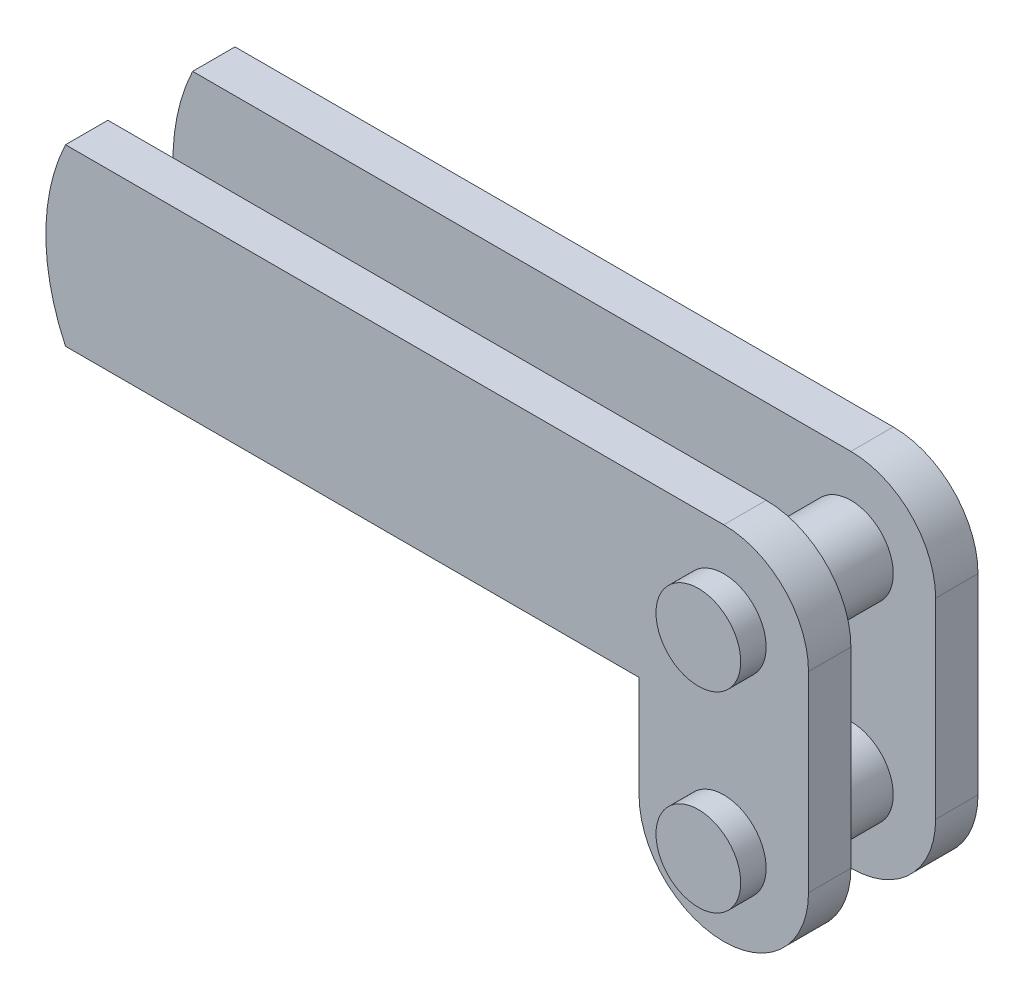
ISO-10303-21;
HEADER;
FILE_DESCRIPTION(('STEP AP214'),'2;1');
FILE_NAME('part.step','',(''),(''),'','','');
FILE_SCHEMA(('AUTOMOTIVE_DESIGN { 1 0 10303 214 1 1 1 1 }'));
ENDSEC;
DATA;
#1=APPLICATION_CONTEXT('core data for automotive mechanical design processes');
#2=APPLICATION_PROTOCOL_DEFINITION('international standard','automotive_design',2000,#1);
#3=PRODUCT_CONTEXT('',#1,'mechanical');
#4=PRODUCT('Part','Part','',(#3));
#5=PRODUCT_RELATED_PRODUCT_CATEGORY('part','',(#4));
#6=PRODUCT_DEFINITION_FORMATION('','',#4);
#7=PRODUCT_DEFINITION_CONTEXT('part definition',#1,'design');
#8=PRODUCT_DEFINITION('design','',#6,#7);
#9=PRODUCT_DEFINITION_SHAPE('','',#8);
#10=(LENGTH_UNIT() NAMED_UNIT(*) SI_UNIT(.MILLI.,.METRE.));
#11=(NAMED_UNIT(*) PLANE_ANGLE_UNIT() SI_UNIT($,.RADIAN.));
#12=(NAMED_UNIT(*) SI_UNIT($,.STERADIAN.) SOLID_ANGLE_UNIT());
#13=UNCERTAINTY_MEASURE_WITH_UNIT(LENGTH_MEASURE(1.E-05),#10,'distance_accuracy_value','');
#14=(GEOMETRIC_REPRESENTATION_CONTEXT(3) GLOBAL_UNCERTAINTY_ASSIGNED_CONTEXT((#13)) GLOBAL_UNIT_ASSIGNED_CONTEXT((#10,
#11,#12)) REPRESENTATION_CONTEXT('',''));
#15=CARTESIAN_POINT('',(0.,0.,0.));
#16=DIRECTION('',(0.,0.,1.));
#17=DIRECTION('',(1.,0.,0.));
#18=AXIS2_PLACEMENT_3D('',#15,#16,#17);
#19=CARTESIAN_POINT('',(-32.9999999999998,-5.15,-5.));
#20=DIRECTION('',(0.,0.,1.));
#21=DIRECTION('',(1.,0.,0.));
#22=AXIS2_PLACEMENT_3D('',#19,#20,#21);
#23=PLANE('',#22);
#24=CARTESIAN_POINT('',(-5.00000000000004,-16.3,-5.));
#25=DIRECTION('',(0.,0.,1.));
#26=DIRECTION('',(1.,0.,0.));
#27=AXIS2_PLACEMENT_3D('',#24,#25,#26);
#28=CIRCLE('',#27,2.5);
#29=CARTESIAN_POINT('',(-7.50000000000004,-16.2999999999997,-5.00000000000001));
#30=VERTEX_POINT('',#29);
#31=EDGE_CURVE('E40',#30,#30,#28,.F.);
#32=ORIENTED_EDGE('',*,*,#31,.F.);
#33=EDGE_LOOP('',(#32));
#34=FACE_BOUND('',#33,.T.);
#35=DIRECTION('',(-1.,0.,0.));
#36=VECTOR('',#35,1.);
#37=CARTESIAN_POINT('',(-43.8387037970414,0.,-5.));
#38=LINE('',#37,#36);
#39=CARTESIAN_POINT('',(-5.00000000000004,0.,-5.));
#40=VERTEX_POINT('',#39);
#41=CARTESIAN_POINT('',(-43.8387037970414,0.,-5.));
#42=VERTEX_POINT('',#41);
#43=EDGE_CURVE('E245',#40,#42,#38,.T.);
#44=ORIENTED_EDGE('',*,*,#43,.F.);
#45=CARTESIAN_POINT('',(-5.00000000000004,-5.,-5.));
#46=DIRECTION('',(0.,0.,1.));
#47=DIRECTION('',(1.,0.,0.));
#48=AXIS2_PLACEMENT_3D('',#45,#46,#47);
#49=CIRCLE('',#48,5.);
#50=CARTESIAN_POINT('',(1.59594559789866E-13,-5.,-5.));
#51=VERTEX_POINT('',#50);
#52=EDGE_CURVE('E172',#40,#51,#49,.F.);
#53=ORIENTED_EDGE('',*,*,#52,.T.);
#54=DIRECTION('',(0.,1.,0.));
#55=VECTOR('',#54,1.);
#56=CARTESIAN_POINT('',(0.,0.,-5.));
#57=LINE('',#56,#55);
#58=CARTESIAN_POINT('',(1.59594559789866E-13,-16.3,-5.));
#59=VERTEX_POINT('',#58);
#60=EDGE_CURVE('E241',#59,#51,#57,.T.);
#61=ORIENTED_EDGE('',*,*,#60,.F.);
#62=CARTESIAN_POINT('',(-5.00000000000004,-16.3,-5.));
#63=DIRECTION('',(0.,0.,1.));
#64=DIRECTION('',(1.,0.,0.));
#65=AXIS2_PLACEMENT_3D('',#62,#63,#64);
#66=CIRCLE('',#65,5.);
#67=CARTESIAN_POINT('',(-5.00000000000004,-21.2999999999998,-5.));
#68=VERTEX_POINT('',#67);
#69=EDGE_CURVE('E231',#59,#68,#66,.F.);
#70=ORIENTED_EDGE('',*,*,#69,.T.);
#71=CARTESIAN_POINT('',(-5.00000000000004,-16.3,-5.));
#72=DIRECTION('',(0.,0.,1.));
#73=DIRECTION('',(1.,0.,0.));
#74=AXIS2_PLACEMENT_3D('',#71,#72,#73);
#75=CIRCLE('',#74,5.);
#76=CARTESIAN_POINT('',(-10.0000000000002,-16.3,-5.));
#77=VERTEX_POINT('',#76);
#78=EDGE_CURVE('E232',#68,#77,#75,.F.);
#79=ORIENTED_EDGE('',*,*,#78,.T.);
#80=DIRECTION('',(0.,-1.,0.));
#81=VECTOR('',#80,1.);
#82=CARTESIAN_POINT('',(-10.,-21.3,-5.));
#83=LINE('',#82,#81);
#84=CARTESIAN_POINT('',(-10.0000000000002,-10.3,-5.));
#85=VERTEX_POINT('',#84);
#86=EDGE_CURVE('E253',#85,#77,#83,.T.);
#87=ORIENTED_EDGE('',*,*,#86,.F.);
#88=DIRECTION('',(1.,0.,0.));
#89=VECTOR('',#88,1.);
#90=CARTESIAN_POINT('',(-10.0000000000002,-10.3,-5.));
#91=LINE('',#90,#89);
#92=CARTESIAN_POINT('',(-43.8387037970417,-10.3,-5.));
#93=VERTEX_POINT('',#92);
#94=EDGE_CURVE('E278',#93,#85,#91,.T.);
#95=ORIENTED_EDGE('',*,*,#94,.F.);
#96=CARTESIAN_POINT('',(-32.9999999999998,-5.15,-5.));
#97=DIRECTION('',(0.,0.,1.));
#98=DIRECTION('',(1.,0.,0.));
#99=AXIS2_PLACEMENT_3D('',#96,#97,#98);
#100=CIRCLE('',#99,12.);
#101=EDGE_CURVE('E275',#42,#93,#100,.T.);
#102=ORIENTED_EDGE('',*,*,#101,.F.);
#103=EDGE_LOOP('',(#44,#53,#61,#70,#79,#87,#95,#102));
#104=FACE_BOUND('',#103,.T.);
#105=CARTESIAN_POINT('',(-5.00000000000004,-5.,-5.));
#106=DIRECTION('',(0.,0.,1.));
#107=DIRECTION('',(1.,0.,0.));
#108=AXIS2_PLACEMENT_3D('',#105,#106,#107);
#109=CIRCLE('',#108,2.5);
#110=CARTESIAN_POINT('',(-7.50000000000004,-4.99999999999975,-5.00000000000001));
#111=VERTEX_POINT('',#110);
#112=EDGE_CURVE('E11',#111,#111,#109,.F.);
#113=ORIENTED_EDGE('',*,*,#112,.F.);
#114=EDGE_LOOP('',(#113));
#115=FACE_BOUND('',#114,.T.);
#116=ADVANCED_FACE('F31',(#34,#104,#115),#23,.F.);
#117=CARTESIAN_POINT('',(-32.9999999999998,-5.14999999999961,5.));
#118=DIRECTION('',(0.,0.,1.));
#119=DIRECTION('',(1.,0.,0.));
#120=AXIS2_PLACEMENT_3D('',#117,#118,#119);
#121=PLANE('',#120);
#122=CARTESIAN_POINT('',(-5.00000000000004,-16.3,5.));
#123=DIRECTION('',(0.,0.,1.));
#124=DIRECTION('',(1.,0.,0.));
#125=AXIS2_PLACEMENT_3D('',#122,#123,#124);
#126=CIRCLE('',#125,2.5);
#127=CARTESIAN_POINT('',(-7.50000000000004,-16.2999999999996,5.));
#128=VERTEX_POINT('',#127);
#129=EDGE_CURVE('E35',#128,#128,#126,.F.);
#130=ORIENTED_EDGE('',*,*,#129,.T.);
#131=EDGE_LOOP('',(#130));
#132=FACE_BOUND('',#131,.T.);
#133=DIRECTION('',(0.,1.,0.));
#134=VECTOR('',#133,1.);
#135=CARTESIAN_POINT('',(0.,0.,5.));
#136=LINE('',#135,#134);
#137=CARTESIAN_POINT('',(1.59594559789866E-13,-16.3,5.));
#138=VERTEX_POINT('',#137);
#139=CARTESIAN_POINT('',(1.59594559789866E-13,-5.,5.));
#140=VERTEX_POINT('',#139);
#141=EDGE_CURVE('E166',#138,#140,#136,.T.);
#142=ORIENTED_EDGE('',*,*,#141,.T.);
#143=CARTESIAN_POINT('',(-5.00000000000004,-4.99999999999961,5.));
#144=DIRECTION('',(0.,0.,1.));
#145=DIRECTION('',(1.,0.,0.));
#146=AXIS2_PLACEMENT_3D('',#143,#144,#145);
#147=CIRCLE('',#146,5.);
#148=CARTESIAN_POINT('',(-5.00000000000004,3.95516952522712E-13,5.));
#149=VERTEX_POINT('',#148);
#150=EDGE_CURVE('E182',#140,#149,#147,.T.);
#151=ORIENTED_EDGE('',*,*,#150,.T.);
#152=DIRECTION('',(-1.,0.,0.));
#153=VECTOR('',#152,1.);
#154=CARTESIAN_POINT('',(-43.8387037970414,0.,5.));
#155=LINE('',#154,#153);
#156=CARTESIAN_POINT('',(-43.8387037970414,0.,5.));
#157=VERTEX_POINT('',#156);
#158=EDGE_CURVE('E209',#149,#157,#155,.T.);
#159=ORIENTED_EDGE('',*,*,#158,.T.);
#160=CARTESIAN_POINT('',(-32.9999999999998,-5.14999999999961,5.));
#161=DIRECTION('',(0.,0.,1.));
#162=DIRECTION('',(1.,0.,0.));
#163=AXIS2_PLACEMENT_3D('',#160,#161,#162);
#164=CIRCLE('',#163,12.);
#165=CARTESIAN_POINT('',(-43.8387037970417,-10.3,5.));
#166=VERTEX_POINT('',#165);
#167=EDGE_CURVE('E211',#157,#166,#164,.T.);
#168=ORIENTED_EDGE('',*,*,#167,.T.);
#169=DIRECTION('',(1.,0.,0.));
#170=VECTOR('',#169,1.);
#171=CARTESIAN_POINT('',(-10.0000000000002,-10.2999999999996,5.));
#172=LINE('',#171,#170);
#173=CARTESIAN_POINT('',(-10.0000000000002,-10.2999999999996,5.));
#174=VERTEX_POINT('',#173);
#175=EDGE_CURVE('E206',#166,#174,#172,.T.);
#176=ORIENTED_EDGE('',*,*,#175,.T.);
#177=DIRECTION('',(0.,-1.,0.));
#178=VECTOR('',#177,1.);
#179=CARTESIAN_POINT('',(-10.,-21.3,5.));
#180=LINE('',#179,#178);
#181=CARTESIAN_POINT('',(-10.0000000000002,-16.3,5.));
#182=VERTEX_POINT('',#181);
#183=EDGE_CURVE('E199',#174,#182,#180,.T.);
#184=ORIENTED_EDGE('',*,*,#183,.T.);
#185=CARTESIAN_POINT('',(-5.00000000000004,-16.3,5.));
#186=DIRECTION('',(0.,0.,1.));
#187=DIRECTION('',(1.,0.,0.));
#188=AXIS2_PLACEMENT_3D('',#185,#186,#187);
#189=CIRCLE('',#188,5.);
#190=CARTESIAN_POINT('',(-5.00000000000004,-21.2999999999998,5.));
#191=VERTEX_POINT('',#190);
#192=EDGE_CURVE('E179',#182,#191,#189,.T.);
#193=ORIENTED_EDGE('',*,*,#192,.T.);
#194=CARTESIAN_POINT('',(-5.00000000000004,-16.3,5.));
#195=DIRECTION('',(0.,0.,1.));
#196=DIRECTION('',(1.,0.,0.));
#197=AXIS2_PLACEMENT_3D('',#194,#195,#196);
#198=CIRCLE('',#197,5.);
#199=EDGE_CURVE('E177',#191,#138,#198,.T.);
#200=ORIENTED_EDGE('',*,*,#199,.T.);
#201=EDGE_LOOP('',(#142,#151,#159,#168,#176,#184,#193,#200));
#202=FACE_BOUND('',#201,.T.);
#203=CARTESIAN_POINT('',(-5.00000000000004,-4.99999999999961,5.));
#204=DIRECTION('',(0.,0.,1.));
#205=DIRECTION('',(1.,0.,0.));
#206=AXIS2_PLACEMENT_3D('',#203,#204,#205);
#207=CIRCLE('',#206,2.5);
#208=CARTESIAN_POINT('',(-7.50000000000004,-4.99999999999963,5.00000000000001));
#209=VERTEX_POINT('',#208);
#210=EDGE_CURVE('E601',#209,#209,#207,.F.);
#211=ORIENTED_EDGE('',*,*,#210,.T.);
#212=EDGE_LOOP('',(#211));
#213=FACE_BOUND('',#212,.T.);
#214=ADVANCED_FACE('F203',(#132,#202,#213),#121,.T.);
#215=CARTESIAN_POINT('',(-32.9999999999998,-5.14999999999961,5.));
#216=DIRECTION('',(0.,0.,-1.));
#217=DIRECTION('',(-1.,0.,0.));
#218=AXIS2_PLACEMENT_3D('',#215,#216,#217);
#219=CYLINDRICAL_SURFACE('',#218,12.);
#220=CARTESIAN_POINT('',(-32.9999999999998,-5.15,-2.5));
#221=DIRECTION('',(0.,0.,1.));
#222=DIRECTION('',(1.,0.,0.));
#223=AXIS2_PLACEMENT_3D('',#220,#221,#222);
#224=CIRCLE('',#223,12.);
#225=CARTESIAN_POINT('',(-43.8387037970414,0.,-2.5));
#226=VERTEX_POINT('',#225);
#227=CARTESIAN_POINT('',(-43.8387037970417,-10.3,-2.5));
#228=VERTEX_POINT('',#227);
#229=EDGE_CURVE('E262',#226,#228,#224,.T.);
#230=ORIENTED_EDGE('',*,*,#229,.F.);
#231=DIRECTION('',(0.,0.,-1.));
#232=VECTOR('',#231,1.);
#233=CARTESIAN_POINT('',(-43.8387037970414,0.,5.));
#234=LINE('',#233,#232);
#235=EDGE_CURVE('E216',#226,#42,#234,.T.);
#236=ORIENTED_EDGE('',*,*,#235,.T.);
#237=ORIENTED_EDGE('',*,*,#101,.T.);
#238=DIRECTION('',(0.,0.,-1.));
#239=VECTOR('',#238,1.);
#240=CARTESIAN_POINT('',(-43.8387037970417,-10.3,5.));
#241=LINE('',#240,#239);
#242=EDGE_CURVE('E223',#228,#93,#241,.T.);
#243=ORIENTED_EDGE('',*,*,#242,.F.);
#244=EDGE_LOOP('',(#230,#236,#237,#243));
#245=FACE_BOUND('',#244,.T.);
#246=ADVANCED_FACE('F323',(#245),#219,.T.);
#247=CARTESIAN_POINT('',(-10.0000000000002,-10.2999999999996,5.));
#248=DIRECTION('',(0.,1.,0.));
#249=DIRECTION('',(-1.,0.,0.));
#250=AXIS2_PLACEMENT_3D('',#247,#248,#249);
#251=PLANE('',#250);
#252=DIRECTION('',(1.,0.,0.));
#253=VECTOR('',#252,1.);
#254=CARTESIAN_POINT('',(-43.8387037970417,-10.3,-2.5));
#255=LINE('',#254,#253);
#256=CARTESIAN_POINT('',(-10.0000000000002,-10.2999999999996,-2.5));
#257=VERTEX_POINT('',#256);
#258=EDGE_CURVE('E269',#228,#257,#255,.T.);
#259=ORIENTED_EDGE('',*,*,#258,.F.);
#260=ORIENTED_EDGE('',*,*,#242,.T.);
#261=ORIENTED_EDGE('',*,*,#94,.T.);
#262=DIRECTION('',(0.,0.,-1.));
#263=VECTOR('',#262,1.);
#264=CARTESIAN_POINT('',(-10.0000000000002,-10.2999999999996,5.));
#265=LINE('',#264,#263);
#266=EDGE_CURVE('E220',#257,#85,#265,.T.);
#267=ORIENTED_EDGE('',*,*,#266,.F.);
#268=EDGE_LOOP('',(#259,#260,#261,#267));
#269=FACE_BOUND('',#268,.T.);
#270=ADVANCED_FACE('F339',(#269),#251,.F.);
#271=CARTESIAN_POINT('',(-10.,-21.3,5.));
#272=DIRECTION('',(1.,0.,0.));
#273=DIRECTION('',(0.,0.,-1.));
#274=AXIS2_PLACEMENT_3D('',#271,#272,#273);
#275=PLANE('',#274);
#276=DIRECTION('',(0.,-1.,0.));
#277=VECTOR('',#276,1.);
#278=CARTESIAN_POINT('',(-10.0000000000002,-10.2999999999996,-2.5));
#279=LINE('',#278,#277);
#280=CARTESIAN_POINT('',(-10.0000000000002,-16.3,-2.5));
#281=VERTEX_POINT('',#280);
#282=EDGE_CURVE('E56',#257,#281,#279,.T.);
#283=ORIENTED_EDGE('',*,*,#282,.F.);
#284=ORIENTED_EDGE('',*,*,#266,.T.);
#285=ORIENTED_EDGE('',*,*,#86,.T.);
#286=DIRECTION('',(0.,0.,-1.));
#287=VECTOR('',#286,1.);
#288=CARTESIAN_POINT('',(-10.0000000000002,-16.3,5.));
#289=LINE('',#288,#287);
#290=EDGE_CURVE('E184',#77,#281,#289,.F.);
#291=ORIENTED_EDGE('',*,*,#290,.T.);
#292=EDGE_LOOP('',(#283,#284,#285,#291));
#293=FACE_BOUND('',#292,.T.);
#294=ADVANCED_FACE('F337',(#293),#275,.F.);
#295=CARTESIAN_POINT('',(0.,0.,5.));
#296=DIRECTION('',(-1.,0.,0.));
#297=DIRECTION('',(0.,-1.,0.));
#298=AXIS2_PLACEMENT_3D('',#295,#296,#297);
#299=PLANE('',#298);
#300=DIRECTION('',(0.,1.,0.));
#301=VECTOR('',#300,1.);
#302=CARTESIAN_POINT('',(1.59594559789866E-13,-16.3,-2.5));
#303=LINE('',#302,#301);
#304=CARTESIAN_POINT('',(1.59594559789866E-13,-16.3,-2.5));
#305=VERTEX_POINT('',#304);
#306=CARTESIAN_POINT('',(1.59594559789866E-13,-5.,-2.5));
#307=VERTEX_POINT('',#306);
#308=EDGE_CURVE('E260',#305,#307,#303,.T.);
#309=ORIENTED_EDGE('',*,*,#308,.F.);
#310=DIRECTION('',(0.,0.,-1.));
#311=VECTOR('',#310,1.);
#312=CARTESIAN_POINT('',(1.59594559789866E-13,-16.3,5.));
#313=LINE('',#312,#311);
#314=EDGE_CURVE('E168',#305,#59,#313,.T.);
#315=ORIENTED_EDGE('',*,*,#314,.T.);
#316=ORIENTED_EDGE('',*,*,#60,.T.);
#317=DIRECTION('',(0.,0.,-1.));
#318=VECTOR('',#317,1.);
#319=CARTESIAN_POINT('',(1.59594559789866E-13,-5.,5.));
#320=LINE('',#319,#318);
#321=EDGE_CURVE('E170',#51,#307,#320,.F.);
#322=ORIENTED_EDGE('',*,*,#321,.T.);
#323=EDGE_LOOP('',(#309,#315,#316,#322));
#324=FACE_BOUND('',#323,.T.);
#325=ADVANCED_FACE('F251',(#324),#299,.F.);
#326=CARTESIAN_POINT('',(-43.8387037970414,0.,5.));
#327=DIRECTION('',(0.,-1.,0.));
#328=DIRECTION('',(0.,0.,-1.));
#329=AXIS2_PLACEMENT_3D('',#326,#327,#328);
#330=PLANE('',#329);
#331=DIRECTION('',(-1.,0.,0.));
#332=VECTOR('',#331,1.);
#333=CARTESIAN_POINT('',(-5.00000000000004,0.,-2.5));
#334=LINE('',#333,#332);
#335=CARTESIAN_POINT('',(-5.00000000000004,0.,-2.5));
#336=VERTEX_POINT('',#335);
#337=EDGE_CURVE('E259',#336,#226,#334,.T.);
#338=ORIENTED_EDGE('',*,*,#337,.F.);
#339=DIRECTION('',(0.,0.,-1.));
#340=VECTOR('',#339,1.);
#341=CARTESIAN_POINT('',(-5.00000000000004,3.95516952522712E-13,5.));
#342=LINE('',#341,#340);
#343=EDGE_CURVE('E227',#336,#40,#342,.T.);
#344=ORIENTED_EDGE('',*,*,#343,.T.);
#345=ORIENTED_EDGE('',*,*,#43,.T.);
#346=ORIENTED_EDGE('',*,*,#235,.F.);
#347=EDGE_LOOP('',(#338,#344,#345,#346));
#348=FACE_BOUND('',#347,.T.);
#349=ADVANCED_FACE('F333',(#348),#330,.F.);
#350=CARTESIAN_POINT('',(-5.00000000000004,-4.99999999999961,5.));
#351=DIRECTION('',(0.,0.,-1.));
#352=DIRECTION('',(-1.,0.,0.));
#353=AXIS2_PLACEMENT_3D('',#350,#351,#352);
#354=CYLINDRICAL_SURFACE('',#353,5.);
#355=ORIENTED_EDGE('',*,*,#343,.F.);
#356=CARTESIAN_POINT('',(-5.00000000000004,-5.,-2.5));
#357=DIRECTION('',(0.,0.,1.));
#358=DIRECTION('',(1.,0.,0.));
#359=AXIS2_PLACEMENT_3D('',#356,#357,#358);
#360=CIRCLE('',#359,5.);
#361=EDGE_CURVE('E257',#307,#336,#360,.T.);
#362=ORIENTED_EDGE('',*,*,#361,.F.);
#363=ORIENTED_EDGE('',*,*,#321,.F.);
#364=ORIENTED_EDGE('',*,*,#52,.F.);
#365=EDGE_LOOP('',(#355,#362,#363,#364));
#366=FACE_BOUND('',#365,.T.);
#367=ADVANCED_FACE('F256',(#366),#354,.T.);
#368=CARTESIAN_POINT('',(-5.00000000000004,-16.3,5.));
#369=DIRECTION('',(0.,0.,-1.));
#370=DIRECTION('',(-1.,0.,0.));
#371=AXIS2_PLACEMENT_3D('',#368,#369,#370);
#372=CYLINDRICAL_SURFACE('',#371,5.);
#373=ORIENTED_EDGE('',*,*,#314,.F.);
#374=CARTESIAN_POINT('',(-5.00000000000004,-16.3,-2.5));
#375=DIRECTION('',(0.,0.,1.));
#376=DIRECTION('',(1.,0.,0.));
#377=AXIS2_PLACEMENT_3D('',#374,#375,#376);
#378=CIRCLE('',#377,5.);
#379=CARTESIAN_POINT('',(-5.00000000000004,-21.2999999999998,-2.5));
#380=VERTEX_POINT('',#379);
#381=EDGE_CURVE('E298',#380,#305,#378,.T.);
#382=ORIENTED_EDGE('',*,*,#381,.F.);
#383=DIRECTION('',(0.,0.,-1.));
#384=VECTOR('',#383,1.);
#385=CARTESIAN_POINT('',(-5.00000000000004,-21.2999999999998,5.));
#386=LINE('',#385,#384);
#387=EDGE_CURVE('E272',#68,#380,#386,.F.);
#388=ORIENTED_EDGE('',*,*,#387,.F.);
#389=ORIENTED_EDGE('',*,*,#69,.F.);
#390=EDGE_LOOP('',(#373,#382,#388,#389));
#391=FACE_BOUND('',#390,.T.);
#392=ADVANCED_FACE('F303',(#391),#372,.T.);
#393=CARTESIAN_POINT('',(-5.00000000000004,-16.3,5.));
#394=DIRECTION('',(0.,0.,-1.));
#395=DIRECTION('',(-1.,0.,0.));
#396=AXIS2_PLACEMENT_3D('',#393,#394,#395);
#397=CYLINDRICAL_SURFACE('',#396,5.);
#398=ORIENTED_EDGE('',*,*,#387,.T.);
#399=EDGE_CURVE('E264',#281,#380,#378,.T.);
#400=ORIENTED_EDGE('',*,*,#399,.F.);
#401=ORIENTED_EDGE('',*,*,#290,.F.);
#402=ORIENTED_EDGE('',*,*,#78,.F.);
#403=EDGE_LOOP('',(#398,#400,#401,#402));
#404=FACE_BOUND('',#403,.T.);
#405=ADVANCED_FACE('F305',(#404),#397,.T.);
#406=CARTESIAN_POINT('',(-5.00000000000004,-16.3,-2.5));
#407=DIRECTION('',(0.,0.,1.));
#408=DIRECTION('',(1.,0.,0.));
#409=AXIS2_PLACEMENT_3D('',#406,#407,#408);
#410=PLANE('',#409);
#411=CARTESIAN_POINT('',(-5.00000000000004,-16.3,-2.5));
#412=DIRECTION('',(0.,0.,1.));
#413=DIRECTION('',(1.,0.,0.));
#414=AXIS2_PLACEMENT_3D('',#411,#412,#413);
#415=CIRCLE('',#414,2.5);
#416=CARTESIAN_POINT('',(-2.50000000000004,-16.3,-2.5));
#417=VERTEX_POINT('',#416);
#418=EDGE_CURVE('E584',#417,#417,#415,.T.);
#419=ORIENTED_EDGE('',*,*,#418,.F.);
#420=EDGE_LOOP('',(#419));
#421=FACE_BOUND('',#420,.T.);
#422=CARTESIAN_POINT('',(-5.00000000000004,-5.,-2.5));
#423=DIRECTION('',(0.,0.,1.));
#424=DIRECTION('',(1.,0.,0.));
#425=AXIS2_PLACEMENT_3D('',#422,#423,#424);
#426=CIRCLE('',#425,2.5);
#427=CARTESIAN_POINT('',(-2.50000000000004,-5.,-2.5));
#428=VERTEX_POINT('',#427);
#429=EDGE_CURVE('E151',#428,#428,#426,.T.);
#430=ORIENTED_EDGE('',*,*,#429,.F.);
#431=EDGE_LOOP('',(#430));
#432=FACE_BOUND('',#431,.T.);
#433=ORIENTED_EDGE('',*,*,#399,.T.);
#434=ORIENTED_EDGE('',*,*,#381,.T.);
#435=ORIENTED_EDGE('',*,*,#308,.T.);
#436=ORIENTED_EDGE('',*,*,#361,.T.);
#437=ORIENTED_EDGE('',*,*,#337,.T.);
#438=ORIENTED_EDGE('',*,*,#229,.T.);
#439=ORIENTED_EDGE('',*,*,#258,.T.);
#440=ORIENTED_EDGE('',*,*,#282,.T.);
#441=EDGE_LOOP('',(#433,#434,#435,#436,#437,#438,#439,#440));
#442=FACE_BOUND('',#441,.T.);
#443=ADVANCED_FACE('F300',(#421,#432,#442),#410,.T.);
#444=CARTESIAN_POINT('',(-5.00000000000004,-16.3,2.5));
#445=DIRECTION('',(0.,0.,1.));
#446=DIRECTION('',(1.,0.,0.));
#447=AXIS2_PLACEMENT_3D('',#444,#445,#446);
#448=PLANE('',#447);
#449=CARTESIAN_POINT('',(-5.00000000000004,-16.3,2.5));
#450=DIRECTION('',(0.,0.,1.));
#451=DIRECTION('',(1.,0.,0.));
#452=AXIS2_PLACEMENT_3D('',#449,#450,#451);
#453=CIRCLE('',#452,2.5);
#454=CARTESIAN_POINT('',(-2.50000000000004,-16.3,2.5));
#455=VERTEX_POINT('',#454);
#456=EDGE_CURVE('E579',#455,#455,#453,.T.);
#457=ORIENTED_EDGE('',*,*,#456,.T.);
#458=EDGE_LOOP('',(#457));
#459=FACE_BOUND('',#458,.T.);
#460=CARTESIAN_POINT('',(-5.00000000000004,-4.99999999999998,2.5));
#461=DIRECTION('',(0.,0.,1.));
#462=DIRECTION('',(1.,0.,0.));
#463=AXIS2_PLACEMENT_3D('',#460,#461,#462);
#464=CIRCLE('',#463,2.5);
#465=CARTESIAN_POINT('',(-2.50000000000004,-4.99999999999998,2.5));
#466=VERTEX_POINT('',#465);
#467=EDGE_CURVE('E582',#466,#466,#464,.T.);
#468=ORIENTED_EDGE('',*,*,#467,.T.);
#469=EDGE_LOOP('',(#468));
#470=FACE_BOUND('',#469,.T.);
#471=CARTESIAN_POINT('',(-5.00000000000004,-16.3,2.5));
#472=DIRECTION('',(0.,0.,1.));
#473=DIRECTION('',(1.,0.,0.));
#474=AXIS2_PLACEMENT_3D('',#471,#472,#473);
#475=CIRCLE('',#474,5.);
#476=CARTESIAN_POINT('',(-10.0000000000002,-16.3,2.5));
#477=VERTEX_POINT('',#476);
#478=CARTESIAN_POINT('',(-5.00000000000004,-21.2999999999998,2.5));
#479=VERTEX_POINT('',#478);
#480=EDGE_CURVE('E160',#477,#479,#475,.T.);
#481=ORIENTED_EDGE('',*,*,#480,.F.);
#482=DIRECTION('',(0.,-1.,0.));
#483=VECTOR('',#482,1.);
#484=CARTESIAN_POINT('',(-10.0000000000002,-10.2999999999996,2.5));
#485=LINE('',#484,#483);
#486=CARTESIAN_POINT('',(-10.0000000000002,-10.2999999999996,2.5));
#487=VERTEX_POINT('',#486);
#488=EDGE_CURVE('E161',#487,#477,#485,.T.);
#489=ORIENTED_EDGE('',*,*,#488,.F.);
#490=DIRECTION('',(1.,0.,0.));
#491=VECTOR('',#490,1.);
#492=CARTESIAN_POINT('',(-43.8387037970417,-10.3,2.5));
#493=LINE('',#492,#491);
#494=CARTESIAN_POINT('',(-43.8387037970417,-10.3,2.5));
#495=VERTEX_POINT('',#494);
#496=EDGE_CURVE('E292',#495,#487,#493,.T.);
#497=ORIENTED_EDGE('',*,*,#496,.F.);
#498=CARTESIAN_POINT('',(-32.9999999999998,-5.14999999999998,2.5));
#499=DIRECTION('',(0.,0.,1.));
#500=DIRECTION('',(1.,0.,0.));
#501=AXIS2_PLACEMENT_3D('',#498,#499,#500);
#502=CIRCLE('',#501,12.);
#503=CARTESIAN_POINT('',(-43.8387037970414,0.,2.5));
#504=VERTEX_POINT('',#503);
#505=EDGE_CURVE('E288',#504,#495,#502,.T.);
#506=ORIENTED_EDGE('',*,*,#505,.F.);
#507=DIRECTION('',(-1.,0.,0.));
#508=VECTOR('',#507,1.);
#509=CARTESIAN_POINT('',(-5.00000000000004,0.,2.5));
#510=LINE('',#509,#508);
#511=CARTESIAN_POINT('',(-5.00000000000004,0.,2.5));
#512=VERTEX_POINT('',#511);
#513=EDGE_CURVE('E295',#512,#504,#510,.T.);
#514=ORIENTED_EDGE('',*,*,#513,.F.);
#515=CARTESIAN_POINT('',(-5.00000000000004,-4.99999999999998,2.5));
#516=DIRECTION('',(0.,0.,1.));
#517=DIRECTION('',(1.,0.,0.));
#518=AXIS2_PLACEMENT_3D('',#515,#516,#517);
#519=CIRCLE('',#518,5.);
#520=CARTESIAN_POINT('',(1.59594559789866E-13,-5.,2.5));
#521=VERTEX_POINT('',#520);
#522=EDGE_CURVE('E147',#521,#512,#519,.T.);
#523=ORIENTED_EDGE('',*,*,#522,.F.);
#524=DIRECTION('',(0.,1.,0.));
#525=VECTOR('',#524,1.);
#526=CARTESIAN_POINT('',(1.59594559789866E-13,-16.3,2.5));
#527=LINE('',#526,#525);
#528=CARTESIAN_POINT('',(1.59594559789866E-13,-16.3,2.5));
#529=VERTEX_POINT('',#528);
#530=EDGE_CURVE('E144',#529,#521,#527,.T.);
#531=ORIENTED_EDGE('',*,*,#530,.F.);
#532=EDGE_CURVE('E48',#479,#529,#475,.T.);
#533=ORIENTED_EDGE('',*,*,#532,.F.);
#534=EDGE_LOOP('',(#481,#489,#497,#506,#514,#523,#531,#533));
#535=FACE_BOUND('',#534,.T.);
#536=ADVANCED_FACE('F145',(#459,#470,#535),#448,.F.);
#537=CARTESIAN_POINT('',(-5.00000000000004,-5.,-2.5));
#538=DIRECTION('',(0.,0.,1.));
#539=DIRECTION('',(1.,0.,0.));
#540=AXIS2_PLACEMENT_3D('',#537,#538,#539);
#541=CYLINDRICAL_SURFACE('',#540,2.5);
#542=ORIENTED_EDGE('',*,*,#429,.T.);
#543=EDGE_LOOP('',(#542));
#544=FACE_BOUND('',#543,.T.);
#545=ORIENTED_EDGE('',*,*,#467,.F.);
#546=EDGE_LOOP('',(#545));
#547=FACE_BOUND('',#546,.T.);
#548=ADVANCED_FACE('F527',(#544,#547),#541,.T.);
#549=CARTESIAN_POINT('',(-5.00000000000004,-16.3,-2.5));
#550=DIRECTION('',(0.,0.,1.));
#551=DIRECTION('',(1.,0.,0.));
#552=AXIS2_PLACEMENT_3D('',#549,#550,#551);
#553=CYLINDRICAL_SURFACE('',#552,2.5);
#554=ORIENTED_EDGE('',*,*,#418,.T.);
#555=EDGE_LOOP('',(#554));
#556=FACE_BOUND('',#555,.T.);
#557=ORIENTED_EDGE('',*,*,#456,.F.);
#558=EDGE_LOOP('',(#557));
#559=FACE_BOUND('',#558,.T.);
#560=ADVANCED_FACE('F519',(#556,#559),#553,.T.);
#561=ORIENTED_EDGE('',*,*,#522,.T.);
#562=EDGE_CURVE('E228',#149,#512,#342,.T.);
#563=ORIENTED_EDGE('',*,*,#562,.F.);
#564=ORIENTED_EDGE('',*,*,#150,.F.);
#565=EDGE_CURVE('E167',#521,#140,#320,.F.);
#566=ORIENTED_EDGE('',*,*,#565,.F.);
#567=EDGE_LOOP('',(#561,#563,#564,#566));
#568=FACE_BOUND('',#567,.T.);
#569=ADVANCED_FACE('F328',(#568),#354,.T.);
#570=ORIENTED_EDGE('',*,*,#562,.T.);
#571=ORIENTED_EDGE('',*,*,#513,.T.);
#572=EDGE_CURVE('E217',#157,#504,#234,.T.);
#573=ORIENTED_EDGE('',*,*,#572,.F.);
#574=ORIENTED_EDGE('',*,*,#158,.F.);
#575=EDGE_LOOP('',(#570,#571,#573,#574));
#576=FACE_BOUND('',#575,.T.);
#577=ADVANCED_FACE('F316',(#576),#330,.F.);
#578=ORIENTED_EDGE('',*,*,#480,.T.);
#579=EDGE_CURVE('E159',#479,#191,#386,.F.);
#580=ORIENTED_EDGE('',*,*,#579,.T.);
#581=ORIENTED_EDGE('',*,*,#192,.F.);
#582=EDGE_CURVE('E183',#477,#182,#289,.F.);
#583=ORIENTED_EDGE('',*,*,#582,.F.);
#584=EDGE_LOOP('',(#578,#580,#581,#583));
#585=FACE_BOUND('',#584,.T.);
#586=ADVANCED_FACE('F201',(#585),#397,.T.);
#587=ORIENTED_EDGE('',*,*,#532,.T.);
#588=EDGE_CURVE('E158',#138,#529,#313,.T.);
#589=ORIENTED_EDGE('',*,*,#588,.F.);
#590=ORIENTED_EDGE('',*,*,#199,.F.);
#591=ORIENTED_EDGE('',*,*,#579,.F.);
#592=EDGE_LOOP('',(#587,#589,#590,#591));
#593=FACE_BOUND('',#592,.T.);
#594=ADVANCED_FACE('F156',(#593),#372,.T.);
#595=ORIENTED_EDGE('',*,*,#588,.T.);
#596=ORIENTED_EDGE('',*,*,#530,.T.);
#597=ORIENTED_EDGE('',*,*,#565,.T.);
#598=ORIENTED_EDGE('',*,*,#141,.F.);
#599=EDGE_LOOP('',(#595,#596,#597,#598));
#600=FACE_BOUND('',#599,.T.);
#601=ADVANCED_FACE('F164',(#600),#299,.F.);
#602=EDGE_CURVE('E221',#174,#487,#265,.T.);
#603=ORIENTED_EDGE('',*,*,#602,.T.);
#604=ORIENTED_EDGE('',*,*,#488,.T.);
#605=ORIENTED_EDGE('',*,*,#582,.T.);
#606=ORIENTED_EDGE('',*,*,#183,.F.);
#607=EDGE_LOOP('',(#603,#604,#605,#606));
#608=FACE_BOUND('',#607,.T.);
#609=ADVANCED_FACE('F197',(#608),#275,.F.);
#610=EDGE_CURVE('E224',#166,#495,#241,.T.);
#611=ORIENTED_EDGE('',*,*,#610,.T.);
#612=ORIENTED_EDGE('',*,*,#496,.T.);
#613=ORIENTED_EDGE('',*,*,#602,.F.);
#614=ORIENTED_EDGE('',*,*,#175,.F.);
#615=EDGE_LOOP('',(#611,#612,#613,#614));
#616=FACE_BOUND('',#615,.T.);
#617=ADVANCED_FACE('F291',(#616),#251,.F.);
#618=ORIENTED_EDGE('',*,*,#572,.T.);
#619=ORIENTED_EDGE('',*,*,#505,.T.);
#620=ORIENTED_EDGE('',*,*,#610,.F.);
#621=ORIENTED_EDGE('',*,*,#167,.F.);
#622=EDGE_LOOP('',(#618,#619,#620,#621));
#623=FACE_BOUND('',#622,.T.);
#624=ADVANCED_FACE('F33',(#623),#219,.T.);
#625=CARTESIAN_POINT('',(-5.00000000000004,-16.2999999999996,6.50000000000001));
#626=DIRECTION('',(0.,0.,1.));
#627=DIRECTION('',(1.,0.,0.));
#628=AXIS2_PLACEMENT_3D('',#625,#626,#627);
#629=PLANE('',#628);
#630=CARTESIAN_POINT('',(-5.00000000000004,-16.2999999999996,6.50000000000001));
#631=DIRECTION('',(0.,0.,1.));
#632=DIRECTION('',(1.,0.,0.));
#633=AXIS2_PLACEMENT_3D('',#630,#631,#632);
#634=CIRCLE('',#633,2.5);
#635=CARTESIAN_POINT('',(-7.50000000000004,-16.2999999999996,6.50000000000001));
#636=VERTEX_POINT('',#635);
#637=EDGE_CURVE('E596',#636,#636,#634,.T.);
#638=ORIENTED_EDGE('',*,*,#637,.T.);
#639=EDGE_LOOP('',(#638));
#640=FACE_BOUND('',#639,.T.);
#641=ADVANCED_FACE('F343',(#640),#629,.T.);
#642=CARTESIAN_POINT('',(-5.00000000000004,-16.2999999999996,6.50000000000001));
#643=DIRECTION('',(0.,0.,-1.));
#644=DIRECTION('',(-1.,0.,0.));
#645=AXIS2_PLACEMENT_3D('',#642,#643,#644);
#646=CYLINDRICAL_SURFACE('',#645,2.5);
#647=CARTESIAN_POINT('',(-7.50000000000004,-16.2999999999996,5.));
#648=CARTESIAN_POINT('',(-7.50000000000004,-16.2999999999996,5.015625));
#649=CARTESIAN_POINT('',(-7.50000000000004,-16.2999999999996,5.03125));
#650=CARTESIAN_POINT('',(-7.50000000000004,-16.2999999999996,5.0625));
#651=CARTESIAN_POINT('',(-7.50000000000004,-16.2999999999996,5.078125));
#652=CARTESIAN_POINT('',(-7.50000000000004,-16.2999999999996,5.109375));
#653=CARTESIAN_POINT('',(-7.50000000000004,-16.2999999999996,5.125));
#654=CARTESIAN_POINT('',(-7.50000000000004,-16.2999999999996,5.15625));
#655=CARTESIAN_POINT('',(-7.50000000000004,-16.2999999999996,5.171875));
#656=CARTESIAN_POINT('',(-7.50000000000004,-16.2999999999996,5.203125));
#657=CARTESIAN_POINT('',(-7.50000000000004,-16.2999999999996,5.21875));
#658=CARTESIAN_POINT('',(-7.50000000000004,-16.2999999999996,5.25));
#659=CARTESIAN_POINT('',(-7.50000000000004,-16.2999999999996,5.265625));
#660=CARTESIAN_POINT('',(-7.50000000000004,-16.2999999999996,5.296875));
#661=CARTESIAN_POINT('',(-7.50000000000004,-16.2999999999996,5.3125));
#662=CARTESIAN_POINT('',(-7.50000000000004,-16.2999999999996,5.34375));
#663=CARTESIAN_POINT('',(-7.50000000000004,-16.2999999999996,5.359375));
#664=CARTESIAN_POINT('',(-7.50000000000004,-16.2999999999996,5.390625));
#665=CARTESIAN_POINT('',(-7.50000000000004,-16.2999999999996,5.40625));
#666=CARTESIAN_POINT('',(-7.50000000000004,-16.2999999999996,5.4375));
#667=CARTESIAN_POINT('',(-7.50000000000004,-16.2999999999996,5.453125));
#668=CARTESIAN_POINT('',(-7.50000000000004,-16.2999999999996,5.484375));
#669=CARTESIAN_POINT('',(-7.50000000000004,-16.2999999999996,5.5));
#670=CARTESIAN_POINT('',(-7.50000000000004,-16.2999999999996,5.53125));
#671=CARTESIAN_POINT('',(-7.50000000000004,-16.2999999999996,5.546875));
#672=CARTESIAN_POINT('',(-7.50000000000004,-16.2999999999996,5.578125));
#673=CARTESIAN_POINT('',(-7.50000000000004,-16.2999999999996,5.59375));
#674=CARTESIAN_POINT('',(-7.50000000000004,-16.2999999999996,5.625));
#675=CARTESIAN_POINT('',(-7.50000000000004,-16.2999999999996,5.640625));
#676=CARTESIAN_POINT('',(-7.50000000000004,-16.2999999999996,5.671875));
#677=CARTESIAN_POINT('',(-7.50000000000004,-16.2999999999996,5.6875));
#678=CARTESIAN_POINT('',(-7.50000000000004,-16.2999999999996,5.71875));
#679=CARTESIAN_POINT('',(-7.50000000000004,-16.2999999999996,5.734375));
#680=CARTESIAN_POINT('',(-7.50000000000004,-16.2999999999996,5.765625));
#681=CARTESIAN_POINT('',(-7.50000000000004,-16.2999999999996,5.78125));
#682=CARTESIAN_POINT('',(-7.50000000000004,-16.2999999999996,5.8125));
#683=CARTESIAN_POINT('',(-7.50000000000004,-16.2999999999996,5.828125));
#684=CARTESIAN_POINT('',(-7.50000000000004,-16.2999999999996,5.859375));
#685=CARTESIAN_POINT('',(-7.50000000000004,-16.2999999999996,5.875));
#686=CARTESIAN_POINT('',(-7.50000000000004,-16.2999999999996,5.90625));
#687=CARTESIAN_POINT('',(-7.50000000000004,-16.2999999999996,5.921875));
#688=CARTESIAN_POINT('',(-7.50000000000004,-16.2999999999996,5.953125));
#689=CARTESIAN_POINT('',(-7.50000000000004,-16.2999999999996,5.96875));
#690=CARTESIAN_POINT('',(-7.50000000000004,-16.2999999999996,6.));
#691=CARTESIAN_POINT('',(-7.50000000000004,-16.2999999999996,6.015625));
#692=CARTESIAN_POINT('',(-7.50000000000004,-16.2999999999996,6.046875));
#693=CARTESIAN_POINT('',(-7.50000000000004,-16.2999999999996,6.0625));
#694=CARTESIAN_POINT('',(-7.50000000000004,-16.2999999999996,6.09375));
#695=CARTESIAN_POINT('',(-7.50000000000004,-16.2999999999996,6.10937500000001));
#696=CARTESIAN_POINT('',(-7.50000000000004,-16.2999999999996,6.14062500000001));
#697=CARTESIAN_POINT('',(-7.50000000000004,-16.2999999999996,6.15625000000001));
#698=CARTESIAN_POINT('',(-7.50000000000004,-16.2999999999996,6.18750000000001));
#699=CARTESIAN_POINT('',(-7.50000000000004,-16.2999999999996,6.20312500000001));
#700=CARTESIAN_POINT('',(-7.50000000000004,-16.2999999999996,6.23437500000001));
#701=CARTESIAN_POINT('',(-7.50000000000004,-16.2999999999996,6.25000000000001));
#702=CARTESIAN_POINT('',(-7.50000000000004,-16.2999999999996,6.28125000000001));
#703=CARTESIAN_POINT('',(-7.50000000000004,-16.2999999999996,6.29687500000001));
#704=CARTESIAN_POINT('',(-7.50000000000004,-16.2999999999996,6.32812500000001));
#705=CARTESIAN_POINT('',(-7.50000000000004,-16.2999999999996,6.34375000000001));
#706=CARTESIAN_POINT('',(-7.50000000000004,-16.2999999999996,6.37500000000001));
#707=CARTESIAN_POINT('',(-7.50000000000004,-16.2999999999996,6.39062500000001));
#708=CARTESIAN_POINT('',(-7.50000000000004,-16.2999999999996,6.42187500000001));
#709=CARTESIAN_POINT('',(-7.50000000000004,-16.2999999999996,6.43750000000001));
#710=CARTESIAN_POINT('',(-7.50000000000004,-16.2999999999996,6.46875000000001));
#711=CARTESIAN_POINT('',(-7.50000000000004,-16.2999999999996,6.48437500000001));
#712=CARTESIAN_POINT('',(-7.50000000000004,-16.2999999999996,6.50000000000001));
#713=B_SPLINE_CURVE_WITH_KNOTS('',3,(#647,#648,#649,#650,#651,#652,#653,#654,#655,#656,#657,
#658,#659,#660,#661,#662,#663,#664,#665,#666,#667,#668,#669,#670,#671,#672,#673,#674,#675,#676,
#677,#678,#679,#680,#681,#682,#683,#684,#685,#686,#687,#688,#689,#690,#691,#692,#693,#694,#695,
#696,#697,#698,#699,#700,#701,#702,#703,#704,#705,#706,#707,#708,#709,#710,#711,#712),
.UNSPECIFIED.,.F.,.F.,(4,2,2,2,2,2,2,2,2,2,2,2,2,2,2,2,2,2,2,2,2,2,2,2,2,2,2,2,2,2,2,2,4),(0.,
0.046875,0.0937500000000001,0.140625,0.1875,0.234375,0.28125,0.328125,0.375,0.421875,0.46875,
0.515625,0.5625,0.609375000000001,0.656250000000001,0.703125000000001,0.750000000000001,
0.796875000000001,0.843750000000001,0.890625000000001,0.937500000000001,0.984375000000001,
1.03125,1.078125,1.125,1.171875,1.21875,1.265625,1.3125,1.359375,1.40625,1.453125,1.5),.UNSPECIFIED.);
#714=EDGE_CURVE('BSEAM401',#128,#636,#713,.T.);
#715=ORIENTED_EDGE('',*,*,#129,.F.);
#716=ORIENTED_EDGE('',*,*,#637,.F.);
#717=ORIENTED_EDGE('',*,*,#714,.T.);
#718=ORIENTED_EDGE('',*,*,#714,.F.);
#719=EDGE_LOOP('',(#715,#717,#716,#718));
#720=FACE_BOUND('',#719,.T.);
#721=ADVANCED_FACE('F401',(#720),#646,.T.);
#722=CARTESIAN_POINT('',(-5.00000000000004,-16.3,-6.50000000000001));
#723=DIRECTION('',(0.,0.,1.));
#724=DIRECTION('',(1.,0.,0.));
#725=AXIS2_PLACEMENT_3D('',#722,#723,#724);
#726=CIRCLE('',#725,2.5);
#727=CARTESIAN_POINT('',(-7.50000000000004,-16.2999999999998,-6.50000000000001));
#728=VERTEX_POINT('',#727);
#729=EDGE_CURVE('E599',#728,#728,#726,.T.);
#730=CARTESIAN_POINT('',(-7.50000000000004,-16.2999999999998,-6.50000000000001));
#731=CARTESIAN_POINT('',(-7.50000000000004,-16.2999999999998,-6.48437500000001));
#732=CARTESIAN_POINT('',(-7.50000000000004,-16.2999999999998,-6.46875000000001));
#733=CARTESIAN_POINT('',(-7.50000000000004,-16.2999999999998,-6.43750000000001));
#734=CARTESIAN_POINT('',(-7.50000000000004,-16.2999999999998,-6.42187500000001));
#735=CARTESIAN_POINT('',(-7.50000000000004,-16.2999999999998,-6.39062500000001));
#736=CARTESIAN_POINT('',(-7.50000000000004,-16.2999999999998,-6.37500000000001));
#737=CARTESIAN_POINT('',(-7.50000000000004,-16.2999999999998,-6.34375000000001));
#738=CARTESIAN_POINT('',(-7.50000000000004,-16.2999999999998,-6.32812500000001));
#739=CARTESIAN_POINT('',(-7.50000000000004,-16.2999999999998,-6.29687500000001));
#740=CARTESIAN_POINT('',(-7.50000000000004,-16.2999999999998,-6.28125000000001));
#741=CARTESIAN_POINT('',(-7.50000000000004,-16.2999999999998,-6.25000000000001));
#742=CARTESIAN_POINT('',(-7.50000000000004,-16.2999999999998,-6.23437500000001));
#743=CARTESIAN_POINT('',(-7.50000000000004,-16.2999999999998,-6.20312500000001));
#744=CARTESIAN_POINT('',(-7.50000000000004,-16.2999999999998,-6.18750000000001));
#745=CARTESIAN_POINT('',(-7.50000000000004,-16.2999999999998,-6.15625000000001));
#746=CARTESIAN_POINT('',(-7.50000000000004,-16.2999999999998,-6.14062500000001));
#747=CARTESIAN_POINT('',(-7.50000000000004,-16.2999999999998,-6.10937500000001));
#748=CARTESIAN_POINT('',(-7.50000000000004,-16.2999999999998,-6.09375000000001));
#749=CARTESIAN_POINT('',(-7.50000000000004,-16.2999999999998,-6.06250000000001));
#750=CARTESIAN_POINT('',(-7.50000000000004,-16.2999999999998,-6.04687500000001));
#751=CARTESIAN_POINT('',(-7.50000000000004,-16.2999999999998,-6.01562500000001));
#752=CARTESIAN_POINT('',(-7.50000000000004,-16.2999999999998,-6.00000000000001));
#753=CARTESIAN_POINT('',(-7.50000000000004,-16.2999999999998,-5.96875000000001));
#754=CARTESIAN_POINT('',(-7.50000000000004,-16.2999999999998,-5.95312500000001));
#755=CARTESIAN_POINT('',(-7.50000000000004,-16.2999999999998,-5.92187500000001));
#756=CARTESIAN_POINT('',(-7.50000000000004,-16.2999999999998,-5.90625000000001));
#757=CARTESIAN_POINT('',(-7.50000000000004,-16.2999999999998,-5.87500000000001));
#758=CARTESIAN_POINT('',(-7.50000000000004,-16.2999999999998,-5.85937500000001));
#759=CARTESIAN_POINT('',(-7.50000000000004,-16.2999999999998,-5.82812500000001));
#760=CARTESIAN_POINT('',(-7.50000000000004,-16.2999999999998,-5.81250000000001));
#761=CARTESIAN_POINT('',(-7.50000000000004,-16.2999999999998,-5.78125000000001));
#762=CARTESIAN_POINT('',(-7.50000000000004,-16.2999999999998,-5.76562500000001));
#763=CARTESIAN_POINT('',(-7.50000000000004,-16.2999999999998,-5.73437500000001));
#764=CARTESIAN_POINT('',(-7.50000000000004,-16.2999999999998,-5.71875000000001));
#765=CARTESIAN_POINT('',(-7.50000000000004,-16.2999999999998,-5.68750000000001));
#766=CARTESIAN_POINT('',(-7.50000000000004,-16.2999999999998,-5.67187500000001));
#767=CARTESIAN_POINT('',(-7.50000000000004,-16.2999999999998,-5.64062500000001));
#768=CARTESIAN_POINT('',(-7.50000000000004,-16.2999999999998,-5.62500000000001));
#769=CARTESIAN_POINT('',(-7.50000000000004,-16.2999999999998,-5.59375000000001));
#770=CARTESIAN_POINT('',(-7.50000000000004,-16.2999999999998,-5.57812500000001));
#771=CARTESIAN_POINT('',(-7.50000000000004,-16.2999999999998,-5.54687500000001));
#772=CARTESIAN_POINT('',(-7.50000000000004,-16.2999999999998,-5.53125000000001));
#773=CARTESIAN_POINT('',(-7.50000000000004,-16.2999999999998,-5.50000000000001));
#774=CARTESIAN_POINT('',(-7.50000000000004,-16.2999999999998,-5.48437500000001));
#775=CARTESIAN_POINT('',(-7.50000000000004,-16.2999999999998,-5.45312500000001));
#776=CARTESIAN_POINT('',(-7.50000000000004,-16.2999999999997,-5.43750000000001));
#777=CARTESIAN_POINT('',(-7.50000000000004,-16.2999999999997,-5.40625000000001));
#778=CARTESIAN_POINT('',(-7.50000000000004,-16.2999999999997,-5.39062500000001));
#779=CARTESIAN_POINT('',(-7.50000000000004,-16.2999999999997,-5.35937500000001));
#780=CARTESIAN_POINT('',(-7.50000000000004,-16.2999999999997,-5.34375000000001));
#781=CARTESIAN_POINT('',(-7.50000000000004,-16.2999999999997,-5.31250000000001));
#782=CARTESIAN_POINT('',(-7.50000000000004,-16.2999999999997,-5.29687500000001));
#783=CARTESIAN_POINT('',(-7.50000000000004,-16.2999999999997,-5.26562500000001));
#784=CARTESIAN_POINT('',(-7.50000000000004,-16.2999999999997,-5.25000000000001));
#785=CARTESIAN_POINT('',(-7.50000000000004,-16.2999999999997,-5.21875000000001));
#786=CARTESIAN_POINT('',(-7.50000000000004,-16.2999999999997,-5.20312500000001));
#787=CARTESIAN_POINT('',(-7.50000000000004,-16.2999999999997,-5.17187500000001));
#788=CARTESIAN_POINT('',(-7.50000000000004,-16.2999999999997,-5.15625000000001));
#789=CARTESIAN_POINT('',(-7.50000000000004,-16.2999999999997,-5.12500000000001));
#790=CARTESIAN_POINT('',(-7.50000000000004,-16.2999999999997,-5.10937500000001));
#791=CARTESIAN_POINT('',(-7.50000000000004,-16.2999999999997,-5.07812500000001));
#792=CARTESIAN_POINT('',(-7.50000000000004,-16.2999999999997,-5.06250000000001));
#793=CARTESIAN_POINT('',(-7.50000000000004,-16.2999999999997,-5.03125000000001));
#794=CARTESIAN_POINT('',(-7.50000000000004,-16.2999999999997,-5.01562500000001));
#795=CARTESIAN_POINT('',(-7.50000000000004,-16.2999999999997,-5.00000000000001));
#796=B_SPLINE_CURVE_WITH_KNOTS('',3,(#730,#731,#732,#733,#734,#735,#736,#737,#738,#739,#740,
#741,#742,#743,#744,#745,#746,#747,#748,#749,#750,#751,#752,#753,#754,#755,#756,#757,#758,#759,
#760,#761,#762,#763,#764,#765,#766,#767,#768,#769,#770,#771,#772,#773,#774,#775,#776,#777,#778,
#779,#780,#781,#782,#783,#784,#785,#786,#787,#788,#789,#790,#791,#792,#793,#794,#795),
.UNSPECIFIED.,.F.,.F.,(4,2,2,2,2,2,2,2,2,2,2,2,2,2,2,2,2,2,2,2,2,2,2,2,2,2,2,2,2,2,2,2,4),(0.,
0.046875,0.0937500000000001,0.140625,0.1875,0.234375,0.28125,0.328125,0.375,0.421875,0.46875,
0.515625,0.5625,0.609375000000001,0.656250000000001,0.703125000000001,0.750000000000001,
0.796875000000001,0.843750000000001,0.890625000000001,0.937500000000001,0.984375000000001,
1.03125,1.078125,1.125,1.171875,1.21875,1.265625,1.3125,1.359375,1.40625,1.453125,1.5),.UNSPECIFIED.);
#797=EDGE_CURVE('BSEAM411',#728,#30,#796,.T.);
#798=ORIENTED_EDGE('',*,*,#729,.T.);
#799=ORIENTED_EDGE('',*,*,#31,.T.);
#800=ORIENTED_EDGE('',*,*,#797,.T.);
#801=ORIENTED_EDGE('',*,*,#797,.F.);
#802=EDGE_LOOP('',(#798,#800,#799,#801));
#803=FACE_BOUND('',#802,.T.);
#804=ADVANCED_FACE('F411',(#803),#646,.T.);
#805=CARTESIAN_POINT('',(-5.00000000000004,-16.3,-6.50000000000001));
#806=DIRECTION('',(0.,0.,1.));
#807=DIRECTION('',(1.,0.,0.));
#808=AXIS2_PLACEMENT_3D('',#805,#806,#807);
#809=PLANE('',#808);
#810=ORIENTED_EDGE('',*,*,#729,.F.);
#811=EDGE_LOOP('',(#810));
#812=FACE_BOUND('',#811,.T.);
#813=ADVANCED_FACE('F420',(#812),#809,.F.);
#814=CARTESIAN_POINT('',(-5.00000000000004,-4.99999999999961,6.50000000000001));
#815=DIRECTION('',(0.,0.,1.));
#816=DIRECTION('',(1.,0.,0.));
#817=AXIS2_PLACEMENT_3D('',#814,#815,#816);
#818=PLANE('',#817);
#819=CARTESIAN_POINT('',(-5.00000000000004,-4.99999999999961,6.50000000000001));
#820=DIRECTION('',(0.,0.,1.));
#821=DIRECTION('',(1.,0.,0.));
#822=AXIS2_PLACEMENT_3D('',#819,#820,#821);
#823=CIRCLE('',#822,2.5);
#824=CARTESIAN_POINT('',(-7.50000000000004,-4.99999999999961,6.50000000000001));
#825=VERTEX_POINT('',#824);
#826=EDGE_CURVE('E605',#825,#825,#823,.T.);
#827=ORIENTED_EDGE('',*,*,#826,.T.);
#828=EDGE_LOOP('',(#827));
#829=FACE_BOUND('',#828,.T.);
#830=ADVANCED_FACE('F428',(#829),#818,.T.);
#831=CARTESIAN_POINT('',(-5.00000000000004,-4.99999999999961,6.50000000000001));
#832=DIRECTION('',(0.,0.,-1.));
#833=DIRECTION('',(-1.,0.,0.));
#834=AXIS2_PLACEMENT_3D('',#831,#832,#833);
#835=CYLINDRICAL_SURFACE('',#834,2.5);
#836=CARTESIAN_POINT('',(-7.50000000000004,-4.99999999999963,5.00000000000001));
#837=CARTESIAN_POINT('',(-7.50000000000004,-4.99999999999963,5.01562500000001));
#838=CARTESIAN_POINT('',(-7.50000000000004,-4.99999999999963,5.03125000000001));
#839=CARTESIAN_POINT('',(-7.50000000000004,-4.99999999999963,5.06250000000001));
#840=CARTESIAN_POINT('',(-7.50000000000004,-4.99999999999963,5.07812500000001));
#841=CARTESIAN_POINT('',(-7.50000000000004,-4.99999999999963,5.10937500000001));
#842=CARTESIAN_POINT('',(-7.50000000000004,-4.99999999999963,5.12500000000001));
#843=CARTESIAN_POINT('',(-7.50000000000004,-4.99999999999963,5.15625000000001));
#844=CARTESIAN_POINT('',(-7.50000000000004,-4.99999999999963,5.17187500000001));
#845=CARTESIAN_POINT('',(-7.50000000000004,-4.99999999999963,5.20312500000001));
#846=CARTESIAN_POINT('',(-7.50000000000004,-4.99999999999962,5.21875));
#847=CARTESIAN_POINT('',(-7.50000000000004,-4.99999999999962,5.25));
#848=CARTESIAN_POINT('',(-7.50000000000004,-4.99999999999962,5.265625));
#849=CARTESIAN_POINT('',(-7.50000000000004,-4.99999999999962,5.296875));
#850=CARTESIAN_POINT('',(-7.50000000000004,-4.99999999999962,5.3125));
#851=CARTESIAN_POINT('',(-7.50000000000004,-4.99999999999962,5.34375));
#852=CARTESIAN_POINT('',(-7.50000000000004,-4.99999999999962,5.359375));
#853=CARTESIAN_POINT('',(-7.50000000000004,-4.99999999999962,5.390625));
#854=CARTESIAN_POINT('',(-7.50000000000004,-4.99999999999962,5.40625));
#855=CARTESIAN_POINT('',(-7.50000000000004,-4.99999999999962,5.4375));
#856=CARTESIAN_POINT('',(-7.50000000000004,-4.99999999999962,5.453125));
#857=CARTESIAN_POINT('',(-7.50000000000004,-4.99999999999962,5.484375));
#858=CARTESIAN_POINT('',(-7.50000000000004,-4.99999999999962,5.50000000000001));
#859=CARTESIAN_POINT('',(-7.50000000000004,-4.99999999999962,5.53125000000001));
#860=CARTESIAN_POINT('',(-7.50000000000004,-4.99999999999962,5.54687500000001));
#861=CARTESIAN_POINT('',(-7.50000000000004,-4.99999999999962,5.57812500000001));
#862=CARTESIAN_POINT('',(-7.50000000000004,-4.99999999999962,5.59375000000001));
#863=CARTESIAN_POINT('',(-7.50000000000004,-4.99999999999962,5.62500000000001));
#864=CARTESIAN_POINT('',(-7.50000000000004,-4.99999999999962,5.64062500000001));
#865=CARTESIAN_POINT('',(-7.50000000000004,-4.99999999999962,5.67187500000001));
#866=CARTESIAN_POINT('',(-7.50000000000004,-4.99999999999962,5.68750000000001));
#867=CARTESIAN_POINT('',(-7.50000000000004,-4.99999999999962,5.71875000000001));
#868=CARTESIAN_POINT('',(-7.50000000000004,-4.99999999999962,5.73437500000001));
#869=CARTESIAN_POINT('',(-7.50000000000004,-4.99999999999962,5.76562500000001));
#870=CARTESIAN_POINT('',(-7.50000000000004,-4.99999999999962,5.78125000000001));
#871=CARTESIAN_POINT('',(-7.50000000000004,-4.99999999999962,5.81250000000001));
#872=CARTESIAN_POINT('',(-7.50000000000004,-4.99999999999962,5.82812500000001));
#873=CARTESIAN_POINT('',(-7.50000000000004,-4.99999999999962,5.85937500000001));
#874=CARTESIAN_POINT('',(-7.50000000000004,-4.99999999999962,5.87500000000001));
#875=CARTESIAN_POINT('',(-7.50000000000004,-4.99999999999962,5.90625000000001));
#876=CARTESIAN_POINT('',(-7.50000000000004,-4.99999999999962,5.92187500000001));
#877=CARTESIAN_POINT('',(-7.50000000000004,-4.99999999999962,5.95312500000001));
#878=CARTESIAN_POINT('',(-7.50000000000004,-4.99999999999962,5.96875000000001));
#879=CARTESIAN_POINT('',(-7.50000000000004,-4.99999999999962,6.00000000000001));
#880=CARTESIAN_POINT('',(-7.50000000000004,-4.99999999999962,6.01562500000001));
#881=CARTESIAN_POINT('',(-7.50000000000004,-4.99999999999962,6.04687500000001));
#882=CARTESIAN_POINT('',(-7.50000000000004,-4.99999999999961,6.06250000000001));
#883=CARTESIAN_POINT('',(-7.50000000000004,-4.99999999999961,6.09375000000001));
#884=CARTESIAN_POINT('',(-7.50000000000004,-4.99999999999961,6.10937500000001));
#885=CARTESIAN_POINT('',(-7.50000000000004,-4.99999999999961,6.14062500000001));
#886=CARTESIAN_POINT('',(-7.50000000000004,-4.99999999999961,6.15625000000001));
#887=CARTESIAN_POINT('',(-7.50000000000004,-4.99999999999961,6.18750000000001));
#888=CARTESIAN_POINT('',(-7.50000000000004,-4.99999999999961,6.20312500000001));
#889=CARTESIAN_POINT('',(-7.50000000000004,-4.99999999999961,6.23437500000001));
#890=CARTESIAN_POINT('',(-7.50000000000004,-4.99999999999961,6.25000000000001));
#891=CARTESIAN_POINT('',(-7.50000000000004,-4.99999999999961,6.28125000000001));
#892=CARTESIAN_POINT('',(-7.50000000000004,-4.99999999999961,6.29687500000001));
#893=CARTESIAN_POINT('',(-7.50000000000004,-4.99999999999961,6.32812500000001));
#894=CARTESIAN_POINT('',(-7.50000000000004,-4.99999999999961,6.34375000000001));
#895=CARTESIAN_POINT('',(-7.50000000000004,-4.99999999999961,6.37500000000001));
#896=CARTESIAN_POINT('',(-7.50000000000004,-4.99999999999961,6.39062500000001));
#897=CARTESIAN_POINT('',(-7.50000000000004,-4.99999999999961,6.42187500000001));
#898=CARTESIAN_POINT('',(-7.50000000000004,-4.99999999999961,6.43750000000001));
#899=CARTESIAN_POINT('',(-7.50000000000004,-4.99999999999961,6.46875000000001));
#900=CARTESIAN_POINT('',(-7.50000000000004,-4.99999999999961,6.48437500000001));
#901=CARTESIAN_POINT('',(-7.50000000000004,-4.99999999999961,6.50000000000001));
#902=B_SPLINE_CURVE_WITH_KNOTS('',3,(#836,#837,#838,#839,#840,#841,#842,#843,#844,#845,#846,
#847,#848,#849,#850,#851,#852,#853,#854,#855,#856,#857,#858,#859,#860,#861,#862,#863,#864,#865,
#866,#867,#868,#869,#870,#871,#872,#873,#874,#875,#876,#877,#878,#879,#880,#881,#882,#883,#884,
#885,#886,#887,#888,#889,#890,#891,#892,#893,#894,#895,#896,#897,#898,#899,#900,#901),
.UNSPECIFIED.,.F.,.F.,(4,2,2,2,2,2,2,2,2,2,2,2,2,2,2,2,2,2,2,2,2,2,2,2,2,2,2,2,2,2,2,2,4),(0.,
0.046875,0.0937500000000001,0.140625,0.1875,0.234374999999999,0.281249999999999,
0.328124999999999,0.374999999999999,0.421875,0.46875,0.515625,0.5625,0.609375,0.65625,0.703125,
0.75,0.796875,0.84375,0.890625,0.9375,0.984375,1.03125,1.078125,1.125,1.171875,1.21875,1.265625,
1.3125,1.359375,1.40625,1.453125,1.5),.UNSPECIFIED.);
#903=EDGE_CURVE('BSEAM437',#209,#825,#902,.T.);
#904=ORIENTED_EDGE('',*,*,#210,.F.);
#905=ORIENTED_EDGE('',*,*,#826,.F.);
#906=ORIENTED_EDGE('',*,*,#903,.T.);
#907=ORIENTED_EDGE('',*,*,#903,.F.);
#908=EDGE_LOOP('',(#904,#906,#905,#907));
#909=FACE_BOUND('',#908,.T.);
#910=ADVANCED_FACE('F437',(#909),#835,.T.);
#911=CARTESIAN_POINT('',(-5.00000000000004,-5.,-6.50000000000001));
#912=DIRECTION('',(0.,0.,1.));
#913=DIRECTION('',(1.,0.,0.));
#914=AXIS2_PLACEMENT_3D('',#911,#912,#913);
#915=CIRCLE('',#914,2.5);
#916=CARTESIAN_POINT('',(-7.50000000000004,-4.99999999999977,-6.50000000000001));
#917=VERTEX_POINT('',#916);
#918=EDGE_CURVE('E608',#917,#917,#915,.T.);
#919=CARTESIAN_POINT('',(-7.50000000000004,-4.99999999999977,-6.50000000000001));
#920=CARTESIAN_POINT('',(-7.50000000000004,-4.99999999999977,-6.48437500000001));
#921=CARTESIAN_POINT('',(-7.50000000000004,-4.99999999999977,-6.46875000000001));
#922=CARTESIAN_POINT('',(-7.50000000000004,-4.99999999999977,-6.43750000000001));
#923=CARTESIAN_POINT('',(-7.50000000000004,-4.99999999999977,-6.42187500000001));
#924=CARTESIAN_POINT('',(-7.50000000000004,-4.99999999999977,-6.39062500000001));
#925=CARTESIAN_POINT('',(-7.50000000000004,-4.99999999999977,-6.37500000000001));
#926=CARTESIAN_POINT('',(-7.50000000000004,-4.99999999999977,-6.34375000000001));
#927=CARTESIAN_POINT('',(-7.50000000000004,-4.99999999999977,-6.32812500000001));
#928=CARTESIAN_POINT('',(-7.50000000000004,-4.99999999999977,-6.29687500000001));
#929=CARTESIAN_POINT('',(-7.50000000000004,-4.99999999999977,-6.28125000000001));
#930=CARTESIAN_POINT('',(-7.50000000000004,-4.99999999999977,-6.25000000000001));
#931=CARTESIAN_POINT('',(-7.50000000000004,-4.99999999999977,-6.23437500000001));
#932=CARTESIAN_POINT('',(-7.50000000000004,-4.99999999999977,-6.20312500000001));
#933=CARTESIAN_POINT('',(-7.50000000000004,-4.99999999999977,-6.18750000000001));
#934=CARTESIAN_POINT('',(-7.50000000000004,-4.99999999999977,-6.15625000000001));
#935=CARTESIAN_POINT('',(-7.50000000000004,-4.99999999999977,-6.14062500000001));
#936=CARTESIAN_POINT('',(-7.50000000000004,-4.99999999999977,-6.10937500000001));
#937=CARTESIAN_POINT('',(-7.50000000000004,-4.99999999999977,-6.09375000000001));
#938=CARTESIAN_POINT('',(-7.50000000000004,-4.99999999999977,-6.06250000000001));
#939=CARTESIAN_POINT('',(-7.50000000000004,-4.99999999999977,-6.04687500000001));
#940=CARTESIAN_POINT('',(-7.50000000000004,-4.99999999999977,-6.01562500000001));
#941=CARTESIAN_POINT('',(-7.50000000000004,-4.99999999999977,-6.00000000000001));
#942=CARTESIAN_POINT('',(-7.50000000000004,-4.99999999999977,-5.96875000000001));
#943=CARTESIAN_POINT('',(-7.50000000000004,-4.99999999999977,-5.95312500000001));
#944=CARTESIAN_POINT('',(-7.50000000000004,-4.99999999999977,-5.92187500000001));
#945=CARTESIAN_POINT('',(-7.50000000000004,-4.99999999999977,-5.90625000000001));
#946=CARTESIAN_POINT('',(-7.50000000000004,-4.99999999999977,-5.87500000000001));
#947=CARTESIAN_POINT('',(-7.50000000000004,-4.99999999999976,-5.85937500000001));
#948=CARTESIAN_POINT('',(-7.50000000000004,-4.99999999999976,-5.82812500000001));
#949=CARTESIAN_POINT('',(-7.50000000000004,-4.99999999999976,-5.81250000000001));
#950=CARTESIAN_POINT('',(-7.50000000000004,-4.99999999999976,-5.78125000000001));
#951=CARTESIAN_POINT('',(-7.50000000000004,-4.99999999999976,-5.76562500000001));
#952=CARTESIAN_POINT('',(-7.50000000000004,-4.99999999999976,-5.73437500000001));
#953=CARTESIAN_POINT('',(-7.50000000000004,-4.99999999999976,-5.71875000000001));
#954=CARTESIAN_POINT('',(-7.50000000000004,-4.99999999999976,-5.68750000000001));
#955=CARTESIAN_POINT('',(-7.50000000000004,-4.99999999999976,-5.67187500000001));
#956=CARTESIAN_POINT('',(-7.50000000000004,-4.99999999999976,-5.64062500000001));
#957=CARTESIAN_POINT('',(-7.50000000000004,-4.99999999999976,-5.62500000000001));
#958=CARTESIAN_POINT('',(-7.50000000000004,-4.99999999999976,-5.59375000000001));
#959=CARTESIAN_POINT('',(-7.50000000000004,-4.99999999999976,-5.57812500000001));
#960=CARTESIAN_POINT('',(-7.50000000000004,-4.99999999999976,-5.54687500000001));
#961=CARTESIAN_POINT('',(-7.50000000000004,-4.99999999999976,-5.53125000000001));
#962=CARTESIAN_POINT('',(-7.50000000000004,-4.99999999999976,-5.50000000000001));
#963=CARTESIAN_POINT('',(-7.50000000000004,-4.99999999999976,-5.48437500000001));
#964=CARTESIAN_POINT('',(-7.50000000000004,-4.99999999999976,-5.45312500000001));
#965=CARTESIAN_POINT('',(-7.50000000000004,-4.99999999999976,-5.43750000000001));
#966=CARTESIAN_POINT('',(-7.50000000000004,-4.99999999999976,-5.40625000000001));
#967=CARTESIAN_POINT('',(-7.50000000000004,-4.99999999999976,-5.39062500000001));
#968=CARTESIAN_POINT('',(-7.50000000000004,-4.99999999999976,-5.35937500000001));
#969=CARTESIAN_POINT('',(-7.50000000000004,-4.99999999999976,-5.34375000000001));
#970=CARTESIAN_POINT('',(-7.50000000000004,-4.99999999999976,-5.31250000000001));
#971=CARTESIAN_POINT('',(-7.50000000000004,-4.99999999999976,-5.29687500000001));
#972=CARTESIAN_POINT('',(-7.50000000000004,-4.99999999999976,-5.26562500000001));
#973=CARTESIAN_POINT('',(-7.50000000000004,-4.99999999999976,-5.25000000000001));
#974=CARTESIAN_POINT('',(-7.50000000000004,-4.99999999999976,-5.21875000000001));
#975=CARTESIAN_POINT('',(-7.50000000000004,-4.99999999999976,-5.20312500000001));
#976=CARTESIAN_POINT('',(-7.50000000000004,-4.99999999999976,-5.17187500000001));
#977=CARTESIAN_POINT('',(-7.50000000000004,-4.99999999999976,-5.15625000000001));
#978=CARTESIAN_POINT('',(-7.50000000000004,-4.99999999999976,-5.12500000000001));
#979=CARTESIAN_POINT('',(-7.50000000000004,-4.99999999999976,-5.10937500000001));
#980=CARTESIAN_POINT('',(-7.50000000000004,-4.99999999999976,-5.07812500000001));
#981=CARTESIAN_POINT('',(-7.50000000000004,-4.99999999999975,-5.06250000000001));
#982=CARTESIAN_POINT('',(-7.50000000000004,-4.99999999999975,-5.03125000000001));
#983=CARTESIAN_POINT('',(-7.50000000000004,-4.99999999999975,-5.01562500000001));
#984=CARTESIAN_POINT('',(-7.50000000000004,-4.99999999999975,-5.00000000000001));
#985=B_SPLINE_CURVE_WITH_KNOTS('',3,(#919,#920,#921,#922,#923,#924,#925,#926,#927,#928,#929,
#930,#931,#932,#933,#934,#935,#936,#937,#938,#939,#940,#941,#942,#943,#944,#945,#946,#947,#948,
#949,#950,#951,#952,#953,#954,#955,#956,#957,#958,#959,#960,#961,#962,#963,#964,#965,#966,#967,
#968,#969,#970,#971,#972,#973,#974,#975,#976,#977,#978,#979,#980,#981,#982,#983,#984),
.UNSPECIFIED.,.F.,.F.,(4,2,2,2,2,2,2,2,2,2,2,2,2,2,2,2,2,2,2,2,2,2,2,2,2,2,2,2,2,2,2,2,4),(0.,
0.046875,0.0937500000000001,0.140625,0.1875,0.234375,0.28125,0.328125,0.375,0.421875,0.46875,
0.515625,0.5625,0.609375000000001,0.656250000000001,0.703125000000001,0.750000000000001,
0.796875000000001,0.843750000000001,0.890625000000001,0.937500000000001,0.984375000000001,
1.03125,1.078125,1.125,1.171875,1.21875,1.265625,1.3125,1.359375,1.40625,1.453125,1.5),.UNSPECIFIED.);
#986=EDGE_CURVE('BSEAM446',#917,#111,#985,.T.);
#987=ORIENTED_EDGE('',*,*,#918,.T.);
#988=ORIENTED_EDGE('',*,*,#112,.T.);
#989=ORIENTED_EDGE('',*,*,#986,.T.);
#990=ORIENTED_EDGE('',*,*,#986,.F.);
#991=EDGE_LOOP('',(#987,#989,#988,#990));
#992=FACE_BOUND('',#991,.T.);
#993=ADVANCED_FACE('F446',(#992),#835,.T.);
#994=CARTESIAN_POINT('',(-5.00000000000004,-5.,-6.50000000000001));
#995=DIRECTION('',(0.,0.,1.));
#996=DIRECTION('',(1.,0.,0.));
#997=AXIS2_PLACEMENT_3D('',#994,#995,#996);
#998=PLANE('',#997);
#999=ORIENTED_EDGE('',*,*,#918,.F.);
#1000=EDGE_LOOP('',(#999));
#1001=FACE_BOUND('',#1000,.T.);
#1002=ADVANCED_FACE('F455',(#1001),#998,.F.);
#1003=CLOSED_SHELL('',(#116,#214,#246,#270,#294,#325,#349,#367,#392,#405,#443,#536,#548,#560,
#569,#577,#586,#594,#601,#609,#617,#624,#641,#721,#804,#813,#830,#910,#993,#1002));
#1004=MANIFOLD_SOLID_BREP('B2',#1003);
#1005=ADVANCED_BREP_SHAPE_REPRESENTATION('',(#18,#1004),#14);
#1006=SHAPE_DEFINITION_REPRESENTATION(#9,#1005);
ENDSEC;
END-ISO-10303-21;
